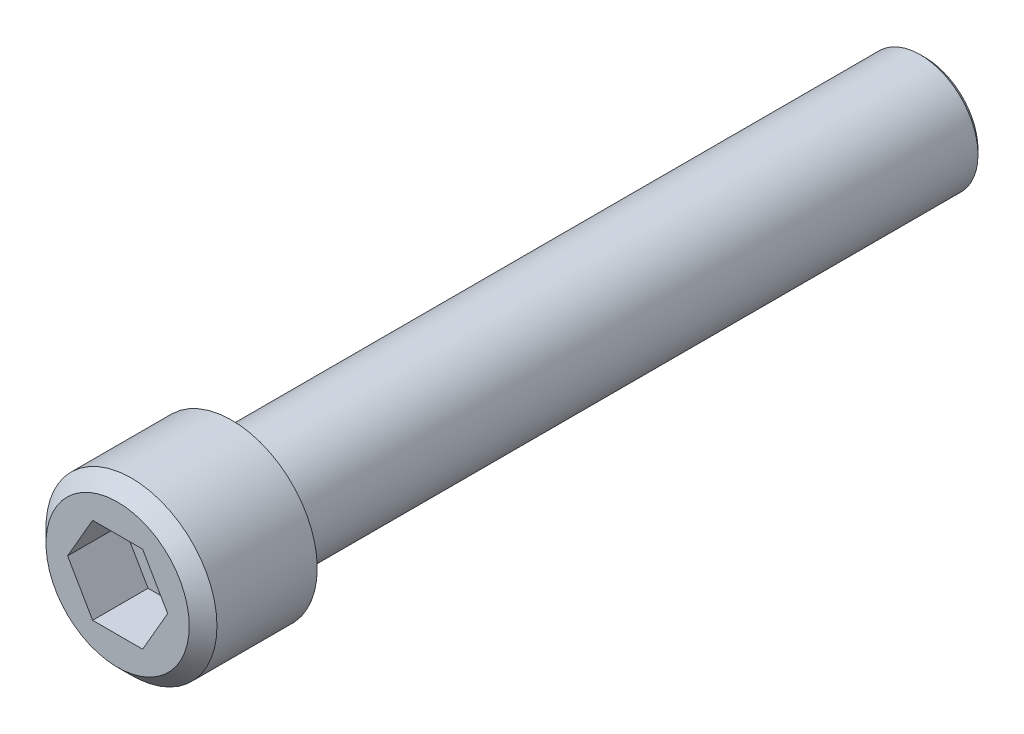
ISO-10303-21;
HEADER;
FILE_DESCRIPTION(('STEP AP214'),'2;1');
FILE_NAME('part.step','',(''),(''),'','','');
FILE_SCHEMA(('AUTOMOTIVE_DESIGN { 1 0 10303 214 1 1 1 1 }'));
ENDSEC;
DATA;
#1=APPLICATION_CONTEXT('core data for automotive mechanical design processes');
#2=APPLICATION_PROTOCOL_DEFINITION('international standard','automotive_design',2000,#1);
#3=PRODUCT_CONTEXT('',#1,'mechanical');
#4=PRODUCT('Part','Part','',(#3));
#5=PRODUCT_RELATED_PRODUCT_CATEGORY('part','',(#4));
#6=PRODUCT_DEFINITION_FORMATION('','',#4);
#7=PRODUCT_DEFINITION_CONTEXT('part definition',#1,'design');
#8=PRODUCT_DEFINITION('design','',#6,#7);
#9=PRODUCT_DEFINITION_SHAPE('','',#8);
#10=(LENGTH_UNIT() NAMED_UNIT(*) SI_UNIT(.MILLI.,.METRE.));
#11=(NAMED_UNIT(*) PLANE_ANGLE_UNIT() SI_UNIT($,.RADIAN.));
#12=(NAMED_UNIT(*) SI_UNIT($,.STERADIAN.) SOLID_ANGLE_UNIT());
#13=UNCERTAINTY_MEASURE_WITH_UNIT(LENGTH_MEASURE(1.E-05),#10,'distance_accuracy_value','');
#14=(GEOMETRIC_REPRESENTATION_CONTEXT(3) GLOBAL_UNCERTAINTY_ASSIGNED_CONTEXT((#13)) GLOBAL_UNIT_ASSIGNED_CONTEXT((#10,
#11,#12)) REPRESENTATION_CONTEXT('',''));
#15=CARTESIAN_POINT('',(0.,0.,0.));
#16=DIRECTION('',(0.,0.,1.));
#17=DIRECTION('',(1.,0.,0.));
#18=AXIS2_PLACEMENT_3D('',#15,#16,#17);
#19=CARTESIAN_POINT('',(0.,0.,-6.2738));
#20=DIRECTION('',(0.,0.,1.));
#21=DIRECTION('',(1.,0.,0.));
#22=AXIS2_PLACEMENT_3D('',#19,#20,#21);
#23=CYLINDRICAL_SURFACE('',#22,4.699);
#24=CARTESIAN_POINT('',(0.,0.,-0.761999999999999));
#25=DIRECTION('',(0.,0.,1.));
#26=DIRECTION('',(1.,0.,0.));
#27=AXIS2_PLACEMENT_3D('',#24,#25,#26);
#28=CIRCLE('',#27,4.699);
#29=CARTESIAN_POINT('',(4.699,0.,-0.762));
#30=VERTEX_POINT('',#29);
#31=EDGE_CURVE('E11',#30,#30,#28,.F.);
#32=CARTESIAN_POINT('',(0.,0.,-6.2738));
#33=DIRECTION('',(0.,0.,1.));
#34=DIRECTION('',(1.,0.,0.));
#35=AXIS2_PLACEMENT_3D('',#32,#33,#34);
#36=CIRCLE('',#35,4.699);
#37=CARTESIAN_POINT('',(4.699,0.,-6.2738));
#38=VERTEX_POINT('',#37);
#39=EDGE_CURVE('E160',#38,#38,#36,.T.);
#40=CARTESIAN_POINT('',(4.699,0.,-0.762));
#41=CARTESIAN_POINT('',(4.699,0.,-0.819414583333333));
#42=CARTESIAN_POINT('',(4.699,0.,-0.876829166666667));
#43=CARTESIAN_POINT('',(4.699,0.,-0.991658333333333));
#44=CARTESIAN_POINT('',(4.699,0.,-1.04907291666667));
#45=CARTESIAN_POINT('',(4.699,0.,-1.16390208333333));
#46=CARTESIAN_POINT('',(4.699,0.,-1.22131666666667));
#47=CARTESIAN_POINT('',(4.699,0.,-1.33614583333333));
#48=CARTESIAN_POINT('',(4.699,0.,-1.39356041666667));
#49=CARTESIAN_POINT('',(4.699,0.,-1.50838958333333));
#50=CARTESIAN_POINT('',(4.699,0.,-1.56580416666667));
#51=CARTESIAN_POINT('',(4.699,0.,-1.68063333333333));
#52=CARTESIAN_POINT('',(4.699,0.,-1.73804791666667));
#53=CARTESIAN_POINT('',(4.699,0.,-1.85287708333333));
#54=CARTESIAN_POINT('',(4.699,0.,-1.91029166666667));
#55=CARTESIAN_POINT('',(4.699,0.,-2.02512083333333));
#56=CARTESIAN_POINT('',(4.699,0.,-2.08253541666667));
#57=CARTESIAN_POINT('',(4.699,0.,-2.19736458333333));
#58=CARTESIAN_POINT('',(4.699,0.,-2.25477916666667));
#59=CARTESIAN_POINT('',(4.699,0.,-2.36960833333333));
#60=CARTESIAN_POINT('',(4.699,0.,-2.42702291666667));
#61=CARTESIAN_POINT('',(4.699,0.,-2.54185208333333));
#62=CARTESIAN_POINT('',(4.699,0.,-2.59926666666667));
#63=CARTESIAN_POINT('',(4.699,0.,-2.71409583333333));
#64=CARTESIAN_POINT('',(4.699,0.,-2.77151041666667));
#65=CARTESIAN_POINT('',(4.699,0.,-2.88633958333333));
#66=CARTESIAN_POINT('',(4.699,0.,-2.94375416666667));
#67=CARTESIAN_POINT('',(4.699,0.,-3.05858333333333));
#68=CARTESIAN_POINT('',(4.699,0.,-3.11599791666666));
#69=CARTESIAN_POINT('',(4.699,0.,-3.23082708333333));
#70=CARTESIAN_POINT('',(4.699,0.,-3.28824166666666));
#71=CARTESIAN_POINT('',(4.699,0.,-3.40307083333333));
#72=CARTESIAN_POINT('',(4.699,0.,-3.46048541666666));
#73=CARTESIAN_POINT('',(4.699,0.,-3.57531458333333));
#74=CARTESIAN_POINT('',(4.699,0.,-3.63272916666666));
#75=CARTESIAN_POINT('',(4.699,0.,-3.74755833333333));
#76=CARTESIAN_POINT('',(4.699,0.,-3.80497291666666));
#77=CARTESIAN_POINT('',(4.699,0.,-3.91980208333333));
#78=CARTESIAN_POINT('',(4.699,0.,-3.97721666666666));
#79=CARTESIAN_POINT('',(4.699,0.,-4.09204583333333));
#80=CARTESIAN_POINT('',(4.699,0.,-4.14946041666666));
#81=CARTESIAN_POINT('',(4.699,0.,-4.26428958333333));
#82=CARTESIAN_POINT('',(4.699,0.,-4.32170416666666));
#83=CARTESIAN_POINT('',(4.699,0.,-4.43653333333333));
#84=CARTESIAN_POINT('',(4.699,0.,-4.49394791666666));
#85=CARTESIAN_POINT('',(4.699,0.,-4.60877708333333));
#86=CARTESIAN_POINT('',(4.699,0.,-4.66619166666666));
#87=CARTESIAN_POINT('',(4.699,0.,-4.78102083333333));
#88=CARTESIAN_POINT('',(4.699,0.,-4.83843541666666));
#89=CARTESIAN_POINT('',(4.699,0.,-4.95326458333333));
#90=CARTESIAN_POINT('',(4.699,0.,-5.01067916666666));
#91=CARTESIAN_POINT('',(4.699,0.,-5.12550833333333));
#92=CARTESIAN_POINT('',(4.699,0.,-5.18292291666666));
#93=CARTESIAN_POINT('',(4.699,0.,-5.29775208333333));
#94=CARTESIAN_POINT('',(4.699,0.,-5.35516666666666));
#95=CARTESIAN_POINT('',(4.699,0.,-5.46999583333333));
#96=CARTESIAN_POINT('',(4.699,0.,-5.52741041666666));
#97=CARTESIAN_POINT('',(4.699,0.,-5.64223958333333));
#98=CARTESIAN_POINT('',(4.699,0.,-5.69965416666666));
#99=CARTESIAN_POINT('',(4.699,0.,-5.81448333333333));
#100=CARTESIAN_POINT('',(4.699,0.,-5.87189791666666));
#101=CARTESIAN_POINT('',(4.699,0.,-5.98672708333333));
#102=CARTESIAN_POINT('',(4.699,0.,-6.04414166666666));
#103=CARTESIAN_POINT('',(4.699,0.,-6.15897083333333));
#104=CARTESIAN_POINT('',(4.699,0.,-6.21638541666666));
#105=CARTESIAN_POINT('',(4.699,0.,-6.2738));
#106=B_SPLINE_CURVE_WITH_KNOTS('',3,(#40,#41,#42,#43,#44,#45,#46,#47,#48,#49,#50,#51,#52,#53,
#54,#55,#56,#57,#58,#59,#60,#61,#62,#63,#64,#65,#66,#67,#68,#69,#70,#71,#72,#73,#74,#75,#76,#77,
#78,#79,#80,#81,#82,#83,#84,#85,#86,#87,#88,#89,#90,#91,#92,#93,#94,#95,#96,#97,#98,#99,#100,
#101,#102,#103,#104,#105),.UNSPECIFIED.,.F.,.F.,(4,2,2,2,2,2,2,2,2,2,2,2,2,2,2,2,2,2,2,2,2,2,2,
2,2,2,2,2,2,2,2,2,4),(0.,0.17224375,0.3444875,0.51673125,0.688975,0.86121875,1.0334625,
1.20570625,1.37795,1.55019375,1.7224375,1.89468125,2.066925,2.23916875,2.4114125,2.58365625,
2.7559,2.92814375,3.1003875,3.27263125,3.444875,3.61711875,3.7893625,3.96160625,4.13385,
4.30609375,4.4783375,4.65058125,4.822825,4.99506875,5.1673125,5.33955625,5.5118),.UNSPECIFIED.);
#107=EDGE_CURVE('BSEAM43',#30,#38,#106,.T.);
#108=ORIENTED_EDGE('',*,*,#31,.T.);
#109=ORIENTED_EDGE('',*,*,#39,.T.);
#110=ORIENTED_EDGE('',*,*,#107,.T.);
#111=ORIENTED_EDGE('',*,*,#107,.F.);
#112=EDGE_LOOP('',(#108,#110,#109,#111));
#113=FACE_BOUND('',#112,.T.);
#114=ADVANCED_FACE('F43',(#113),#23,.T.);
#115=CARTESIAN_POINT('',(0.,0.,-6.2738));
#116=DIRECTION('',(0.,0.,1.));
#117=DIRECTION('',(1.,0.,0.));
#118=AXIS2_PLACEMENT_3D('',#115,#116,#117);
#119=PLANE('',#118);
#120=CARTESIAN_POINT('',(0.,0.,-6.2738));
#121=DIRECTION('',(0.,0.,1.));
#122=DIRECTION('',(1.,0.,0.));
#123=AXIS2_PLACEMENT_3D('',#120,#121,#122);
#124=CIRCLE('',#123,3.175);
#125=CARTESIAN_POINT('',(3.175,0.,-6.2738));
#126=VERTEX_POINT('',#125);
#127=EDGE_CURVE('E172',#126,#126,#124,.F.);
#128=ORIENTED_EDGE('',*,*,#127,.F.);
#129=EDGE_LOOP('',(#128));
#130=FACE_BOUND('',#129,.T.);
#131=ORIENTED_EDGE('',*,*,#39,.F.);
#132=EDGE_LOOP('',(#131));
#133=FACE_BOUND('',#132,.T.);
#134=ADVANCED_FACE('F200',(#130,#133),#119,.F.);
#135=CARTESIAN_POINT('',(0.,0.,0.));
#136=DIRECTION('',(0.,0.,1.));
#137=DIRECTION('',(1.,0.,0.));
#138=AXIS2_PLACEMENT_3D('',#135,#136,#137);
#139=PLANE('',#138);
#140=CARTESIAN_POINT('',(0.,0.,0.));
#141=DIRECTION('',(0.,0.,1.));
#142=DIRECTION('',(1.,0.,0.));
#143=AXIS2_PLACEMENT_3D('',#140,#141,#142);
#144=CIRCLE('',#143,3.937);
#145=CARTESIAN_POINT('',(3.937,0.,0.));
#146=VERTEX_POINT('',#145);
#147=EDGE_CURVE('E52',#146,#146,#144,.T.);
#148=ORIENTED_EDGE('',*,*,#147,.T.);
#149=EDGE_LOOP('',(#148));
#150=FACE_BOUND('',#149,.T.);
#151=DIRECTION('',(0.5,0.866025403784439,0.));
#152=VECTOR('',#151,1.);
#153=CARTESIAN_POINT('',(1.37481532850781,-2.38125,0.));
#154=LINE('',#153,#152);
#155=CARTESIAN_POINT('',(1.37481532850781,-2.38125,0.));
#156=VERTEX_POINT('',#155);
#157=CARTESIAN_POINT('',(2.74963065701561,0.,0.));
#158=VERTEX_POINT('',#157);
#159=EDGE_CURVE('E59',#156,#158,#154,.T.);
#160=ORIENTED_EDGE('',*,*,#159,.F.);
#161=DIRECTION('',(1.,0.,0.));
#162=VECTOR('',#161,1.);
#163=CARTESIAN_POINT('',(-1.37481532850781,-2.38125,0.));
#164=LINE('',#163,#162);
#165=CARTESIAN_POINT('',(-1.37481532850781,-2.38125,0.));
#166=VERTEX_POINT('',#165);
#167=EDGE_CURVE('E154',#166,#156,#164,.T.);
#168=ORIENTED_EDGE('',*,*,#167,.F.);
#169=DIRECTION('',(0.5,-0.866025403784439,0.));
#170=VECTOR('',#169,1.);
#171=CARTESIAN_POINT('',(-2.74963065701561,0.,0.));
#172=LINE('',#171,#170);
#173=CARTESIAN_POINT('',(-2.74963065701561,0.,0.));
#174=VERTEX_POINT('',#173);
#175=EDGE_CURVE('E151',#174,#166,#172,.T.);
#176=ORIENTED_EDGE('',*,*,#175,.F.);
#177=DIRECTION('',(-0.5,-0.866025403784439,0.));
#178=VECTOR('',#177,1.);
#179=CARTESIAN_POINT('',(-1.37481532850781,2.38125,0.));
#180=LINE('',#179,#178);
#181=CARTESIAN_POINT('',(-1.37481532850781,2.38125,0.));
#182=VERTEX_POINT('',#181);
#183=EDGE_CURVE('E107',#182,#174,#180,.T.);
#184=ORIENTED_EDGE('',*,*,#183,.F.);
#185=DIRECTION('',(-1.,0.,0.));
#186=VECTOR('',#185,1.);
#187=CARTESIAN_POINT('',(1.37481532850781,2.38125,0.));
#188=LINE('',#187,#186);
#189=CARTESIAN_POINT('',(1.37481532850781,2.38125,0.));
#190=VERTEX_POINT('',#189);
#191=EDGE_CURVE('E146',#190,#182,#188,.T.);
#192=ORIENTED_EDGE('',*,*,#191,.F.);
#193=DIRECTION('',(-0.5,0.866025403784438,0.));
#194=VECTOR('',#193,1.);
#195=CARTESIAN_POINT('',(2.74963065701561,0.,0.));
#196=LINE('',#195,#194);
#197=EDGE_CURVE('E142',#158,#190,#196,.T.);
#198=ORIENTED_EDGE('',*,*,#197,.F.);
#199=EDGE_LOOP('',(#160,#168,#176,#184,#192,#198));
#200=FACE_BOUND('',#199,.T.);
#201=ADVANCED_FACE('F188',(#150,#200),#139,.T.);
#202=CARTESIAN_POINT('',(0.,0.,-44.3738));
#203=DIRECTION('',(0.,0.,1.));
#204=DIRECTION('',(1.,0.,0.));
#205=AXIS2_PLACEMENT_3D('',#202,#203,#204);
#206=CYLINDRICAL_SURFACE('',#205,3.175);
#207=CARTESIAN_POINT('',(0.,0.,-44.1198));
#208=DIRECTION('',(0.,0.,-1.));
#209=DIRECTION('',(-1.,0.,0.));
#210=AXIS2_PLACEMENT_3D('',#207,#208,#209);
#211=CIRCLE('',#210,3.175);
#212=CARTESIAN_POINT('',(3.175,0.,-44.1198));
#213=VERTEX_POINT('',#212);
#214=EDGE_CURVE('E180',#213,#213,#211,.F.);
#215=CARTESIAN_POINT('',(3.175,0.,-44.1198));
#216=CARTESIAN_POINT('',(3.175,0.,-43.7255708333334));
#217=CARTESIAN_POINT('',(3.175,0.,-43.3313416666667));
#218=CARTESIAN_POINT('',(3.175,0.,-42.5428833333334));
#219=CARTESIAN_POINT('',(3.175,0.,-42.1486541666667));
#220=CARTESIAN_POINT('',(3.175,0.,-41.3601958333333));
#221=CARTESIAN_POINT('',(3.175,0.,-40.9659666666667));
#222=CARTESIAN_POINT('',(3.175,0.,-40.1775083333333));
#223=CARTESIAN_POINT('',(3.175,0.,-39.7832791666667));
#224=CARTESIAN_POINT('',(3.175,0.,-38.9948208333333));
#225=CARTESIAN_POINT('',(3.175,0.,-38.6005916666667));
#226=CARTESIAN_POINT('',(3.175,0.,-37.8121333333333));
#227=CARTESIAN_POINT('',(3.175,0.,-37.4179041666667));
#228=CARTESIAN_POINT('',(3.175,0.,-36.6294458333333));
#229=CARTESIAN_POINT('',(3.175,0.,-36.2352166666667));
#230=CARTESIAN_POINT('',(3.175,0.,-35.4467583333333));
#231=CARTESIAN_POINT('',(3.175,0.,-35.0525291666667));
#232=CARTESIAN_POINT('',(3.175,0.,-34.2640708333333));
#233=CARTESIAN_POINT('',(3.175,0.,-33.8698416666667));
#234=CARTESIAN_POINT('',(3.175,0.,-33.0813833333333));
#235=CARTESIAN_POINT('',(3.175,0.,-32.6871541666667));
#236=CARTESIAN_POINT('',(3.175,0.,-31.8986958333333));
#237=CARTESIAN_POINT('',(3.175,0.,-31.5044666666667));
#238=CARTESIAN_POINT('',(3.175,0.,-30.7160083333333));
#239=CARTESIAN_POINT('',(3.175,0.,-30.3217791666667));
#240=CARTESIAN_POINT('',(3.175,0.,-29.5333208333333));
#241=CARTESIAN_POINT('',(3.175,0.,-29.1390916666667));
#242=CARTESIAN_POINT('',(3.175,0.,-28.3506333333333));
#243=CARTESIAN_POINT('',(3.175,0.,-27.9564041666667));
#244=CARTESIAN_POINT('',(3.175,0.,-27.1679458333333));
#245=CARTESIAN_POINT('',(3.175,0.,-26.7737166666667));
#246=CARTESIAN_POINT('',(3.175,0.,-25.9852583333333));
#247=CARTESIAN_POINT('',(3.175,0.,-25.5910291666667));
#248=CARTESIAN_POINT('',(3.175,0.,-24.8025708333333));
#249=CARTESIAN_POINT('',(3.175,0.,-24.4083416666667));
#250=CARTESIAN_POINT('',(3.175,0.,-23.6198833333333));
#251=CARTESIAN_POINT('',(3.175,0.,-23.2256541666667));
#252=CARTESIAN_POINT('',(3.175,0.,-22.4371958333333));
#253=CARTESIAN_POINT('',(3.175,0.,-22.0429666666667));
#254=CARTESIAN_POINT('',(3.175,0.,-21.2545083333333));
#255=CARTESIAN_POINT('',(3.175,0.,-20.8602791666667));
#256=CARTESIAN_POINT('',(3.175,0.,-20.0718208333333));
#257=CARTESIAN_POINT('',(3.175,0.,-19.6775916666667));
#258=CARTESIAN_POINT('',(3.175,0.,-18.8891333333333));
#259=CARTESIAN_POINT('',(3.175,0.,-18.4949041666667));
#260=CARTESIAN_POINT('',(3.175,0.,-17.7064458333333));
#261=CARTESIAN_POINT('',(3.175,0.,-17.3122166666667));
#262=CARTESIAN_POINT('',(3.175,0.,-16.5237583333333));
#263=CARTESIAN_POINT('',(3.175,0.,-16.1295291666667));
#264=CARTESIAN_POINT('',(3.175,0.,-15.3410708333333));
#265=CARTESIAN_POINT('',(3.175,0.,-14.9468416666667));
#266=CARTESIAN_POINT('',(3.175,0.,-14.1583833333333));
#267=CARTESIAN_POINT('',(3.175,0.,-13.7641541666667));
#268=CARTESIAN_POINT('',(3.175,0.,-12.9756958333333));
#269=CARTESIAN_POINT('',(3.175,0.,-12.5814666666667));
#270=CARTESIAN_POINT('',(3.175,0.,-11.7930083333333));
#271=CARTESIAN_POINT('',(3.175,0.,-11.3987791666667));
#272=CARTESIAN_POINT('',(3.175,0.,-10.6103208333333));
#273=CARTESIAN_POINT('',(3.175,0.,-10.2160916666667));
#274=CARTESIAN_POINT('',(3.175,0.,-9.42763333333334));
#275=CARTESIAN_POINT('',(3.175,0.,-9.03340416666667));
#276=CARTESIAN_POINT('',(3.175,0.,-8.24494583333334));
#277=CARTESIAN_POINT('',(3.175,0.,-7.85071666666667));
#278=CARTESIAN_POINT('',(3.175,0.,-7.06225833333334));
#279=CARTESIAN_POINT('',(3.175,0.,-6.66802916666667));
#280=CARTESIAN_POINT('',(3.175,0.,-6.2738));
#281=B_SPLINE_CURVE_WITH_KNOTS('',3,(#215,#216,#217,#218,#219,#220,#221,#222,#223,#224,#225,
#226,#227,#228,#229,#230,#231,#232,#233,#234,#235,#236,#237,#238,#239,#240,#241,#242,#243,#244,
#245,#246,#247,#248,#249,#250,#251,#252,#253,#254,#255,#256,#257,#258,#259,#260,#261,#262,#263,
#264,#265,#266,#267,#268,#269,#270,#271,#272,#273,#274,#275,#276,#277,#278,#279,#280),
.UNSPECIFIED.,.F.,.F.,(4,2,2,2,2,2,2,2,2,2,2,2,2,2,2,2,2,2,2,2,2,2,2,2,2,2,2,2,2,2,2,2,4),(0.,
1.1826875,2.365375,3.5480625,4.73075000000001,5.91343750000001,7.09612500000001,8.2788125,
9.4615,10.6441875,11.826875,13.0095625,14.19225,15.3749375,16.557625,17.7403125,18.923,
20.1056875,21.288375,22.4710625,23.65375,24.8364375,26.019125,27.2018125,28.3845,29.5671875,
30.749875,31.9325625,33.11525,34.2979375,35.480625,36.6633125,37.846),.UNSPECIFIED.);
#282=EDGE_CURVE('BSEAM211',#213,#126,#281,.T.);
#283=ORIENTED_EDGE('',*,*,#214,.T.);
#284=ORIENTED_EDGE('',*,*,#127,.T.);
#285=ORIENTED_EDGE('',*,*,#282,.T.);
#286=ORIENTED_EDGE('',*,*,#282,.F.);
#287=EDGE_LOOP('',(#283,#285,#284,#286));
#288=FACE_BOUND('',#287,.T.);
#289=ADVANCED_FACE('F211',(#288),#206,.T.);
#290=CARTESIAN_POINT('',(0.,0.,-44.3738));
#291=DIRECTION('',(0.,0.,-1.));
#292=DIRECTION('',(-1.,0.,0.));
#293=AXIS2_PLACEMENT_3D('',#290,#291,#292);
#294=PLANE('',#293);
#295=CARTESIAN_POINT('',(0.,0.,-44.3738));
#296=DIRECTION('',(0.,0.,-1.));
#297=DIRECTION('',(-1.,0.,0.));
#298=AXIS2_PLACEMENT_3D('',#295,#296,#297);
#299=CIRCLE('',#298,2.921);
#300=CARTESIAN_POINT('',(-2.921,0.,-44.3738));
#301=VERTEX_POINT('',#300);
#302=EDGE_CURVE('E176',#301,#301,#299,.T.);
#303=ORIENTED_EDGE('',*,*,#302,.T.);
#304=EDGE_LOOP('',(#303));
#305=FACE_BOUND('',#304,.T.);
#306=ADVANCED_FACE('F215',(#305),#294,.T.);
#307=CARTESIAN_POINT('',(1.37481532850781,-2.38125,-3.048));
#308=DIRECTION('',(0.866025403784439,-0.5,0.));
#309=DIRECTION('',(0.5,0.866025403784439,0.));
#310=AXIS2_PLACEMENT_3D('',#307,#308,#309);
#311=PLANE('',#310);
#312=ORIENTED_EDGE('',*,*,#159,.T.);
#313=DIRECTION('',(0.,0.,1.));
#314=VECTOR('',#313,1.);
#315=CARTESIAN_POINT('',(2.74963065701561,0.,-3.048));
#316=LINE('',#315,#314);
#317=CARTESIAN_POINT('',(2.74963065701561,0.,-3.048));
#318=VERTEX_POINT('',#317);
#319=EDGE_CURVE('E89',#318,#158,#316,.T.);
#320=ORIENTED_EDGE('',*,*,#319,.F.);
#321=DIRECTION('',(0.5,0.866025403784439,0.));
#322=VECTOR('',#321,1.);
#323=CARTESIAN_POINT('',(1.37481532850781,-2.38125,-3.048));
#324=LINE('',#323,#322);
#325=CARTESIAN_POINT('',(1.37481532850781,-2.38125,-3.048));
#326=VERTEX_POINT('',#325);
#327=EDGE_CURVE('E157',#326,#318,#324,.T.);
#328=ORIENTED_EDGE('',*,*,#327,.F.);
#329=DIRECTION('',(0.,0.,1.));
#330=VECTOR('',#329,1.);
#331=CARTESIAN_POINT('',(1.37481532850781,-2.38125,-3.048));
#332=LINE('',#331,#330);
#333=EDGE_CURVE('E67',#326,#156,#332,.T.);
#334=ORIENTED_EDGE('',*,*,#333,.T.);
#335=EDGE_LOOP('',(#312,#320,#328,#334));
#336=FACE_BOUND('',#335,.T.);
#337=ADVANCED_FACE('F219',(#336),#311,.F.);
#338=CARTESIAN_POINT('',(-1.37481532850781,-2.38125,-3.048));
#339=DIRECTION('',(0.,-1.,0.));
#340=DIRECTION('',(0.,0.,-1.));
#341=AXIS2_PLACEMENT_3D('',#338,#339,#340);
#342=PLANE('',#341);
#343=ORIENTED_EDGE('',*,*,#167,.T.);
#344=ORIENTED_EDGE('',*,*,#333,.F.);
#345=DIRECTION('',(1.,0.,0.));
#346=VECTOR('',#345,1.);
#347=CARTESIAN_POINT('',(-1.37481532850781,-2.38125,-3.048));
#348=LINE('',#347,#346);
#349=CARTESIAN_POINT('',(-1.37481532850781,-2.38125,-3.048));
#350=VERTEX_POINT('',#349);
#351=EDGE_CURVE('E121',#350,#326,#348,.T.);
#352=ORIENTED_EDGE('',*,*,#351,.F.);
#353=DIRECTION('',(0.,0.,1.));
#354=VECTOR('',#353,1.);
#355=CARTESIAN_POINT('',(-1.37481532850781,-2.38125,-3.048));
#356=LINE('',#355,#354);
#357=EDGE_CURVE('E112',#350,#166,#356,.T.);
#358=ORIENTED_EDGE('',*,*,#357,.T.);
#359=EDGE_LOOP('',(#343,#344,#352,#358));
#360=FACE_BOUND('',#359,.T.);
#361=ADVANCED_FACE('F223',(#360),#342,.F.);
#362=CARTESIAN_POINT('',(-2.74963065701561,0.,-3.048));
#363=DIRECTION('',(-0.866025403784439,-0.5,0.));
#364=DIRECTION('',(0.5,-0.866025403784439,0.));
#365=AXIS2_PLACEMENT_3D('',#362,#363,#364);
#366=PLANE('',#365);
#367=ORIENTED_EDGE('',*,*,#175,.T.);
#368=ORIENTED_EDGE('',*,*,#357,.F.);
#369=DIRECTION('',(0.5,-0.866025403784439,0.));
#370=VECTOR('',#369,1.);
#371=CARTESIAN_POINT('',(-2.74963065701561,0.,-3.048));
#372=LINE('',#371,#370);
#373=CARTESIAN_POINT('',(-2.74963065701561,0.,-3.048));
#374=VERTEX_POINT('',#373);
#375=EDGE_CURVE('E116',#374,#350,#372,.T.);
#376=ORIENTED_EDGE('',*,*,#375,.F.);
#377=DIRECTION('',(0.,0.,1.));
#378=VECTOR('',#377,1.);
#379=CARTESIAN_POINT('',(-2.74963065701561,0.,-3.048));
#380=LINE('',#379,#378);
#381=EDGE_CURVE('E100',#374,#174,#380,.T.);
#382=ORIENTED_EDGE('',*,*,#381,.T.);
#383=EDGE_LOOP('',(#367,#368,#376,#382));
#384=FACE_BOUND('',#383,.T.);
#385=ADVANCED_FACE('F117',(#384),#366,.F.);
#386=CARTESIAN_POINT('',(-1.37481532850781,2.38125,-3.048));
#387=DIRECTION('',(-0.866025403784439,0.5,0.));
#388=DIRECTION('',(-0.5,-0.866025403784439,0.));
#389=AXIS2_PLACEMENT_3D('',#386,#387,#388);
#390=PLANE('',#389);
#391=ORIENTED_EDGE('',*,*,#183,.T.);
#392=ORIENTED_EDGE('',*,*,#381,.F.);
#393=DIRECTION('',(-0.5,-0.866025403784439,0.));
#394=VECTOR('',#393,1.);
#395=CARTESIAN_POINT('',(-1.37481532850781,2.38125,-3.048));
#396=LINE('',#395,#394);
#397=CARTESIAN_POINT('',(-1.37481532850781,2.38125,-3.048));
#398=VERTEX_POINT('',#397);
#399=EDGE_CURVE('E104',#398,#374,#396,.T.);
#400=ORIENTED_EDGE('',*,*,#399,.F.);
#401=DIRECTION('',(0.,0.,1.));
#402=VECTOR('',#401,1.);
#403=CARTESIAN_POINT('',(-1.37481532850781,2.38125,-3.048));
#404=LINE('',#403,#402);
#405=EDGE_CURVE('E113',#398,#182,#404,.T.);
#406=ORIENTED_EDGE('',*,*,#405,.T.);
#407=EDGE_LOOP('',(#391,#392,#400,#406));
#408=FACE_BOUND('',#407,.T.);
#409=ADVANCED_FACE('F102',(#408),#390,.F.);
#410=CARTESIAN_POINT('',(1.37481532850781,2.38125,-3.048));
#411=DIRECTION('',(0.,1.,0.));
#412=DIRECTION('',(0.,0.,1.));
#413=AXIS2_PLACEMENT_3D('',#410,#411,#412);
#414=PLANE('',#413);
#415=ORIENTED_EDGE('',*,*,#191,.T.);
#416=ORIENTED_EDGE('',*,*,#405,.F.);
#417=DIRECTION('',(-1.,0.,0.));
#418=VECTOR('',#417,1.);
#419=CARTESIAN_POINT('',(1.37481532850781,2.38125,-3.048));
#420=LINE('',#419,#418);
#421=CARTESIAN_POINT('',(1.37481532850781,2.38125,-3.048));
#422=VERTEX_POINT('',#421);
#423=EDGE_CURVE('E127',#422,#398,#420,.T.);
#424=ORIENTED_EDGE('',*,*,#423,.F.);
#425=DIRECTION('',(0.,0.,1.));
#426=VECTOR('',#425,1.);
#427=CARTESIAN_POINT('',(1.37481532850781,2.38125,-3.048));
#428=LINE('',#427,#426);
#429=EDGE_CURVE('E164',#422,#190,#428,.T.);
#430=ORIENTED_EDGE('',*,*,#429,.T.);
#431=EDGE_LOOP('',(#415,#416,#424,#430));
#432=FACE_BOUND('',#431,.T.);
#433=ADVANCED_FACE('F227',(#432),#414,.F.);
#434=CARTESIAN_POINT('',(2.74963065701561,0.,-3.048));
#435=DIRECTION('',(0.866025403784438,0.5,0.));
#436=DIRECTION('',(-0.5,0.866025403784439,0.));
#437=AXIS2_PLACEMENT_3D('',#434,#435,#436);
#438=PLANE('',#437);
#439=ORIENTED_EDGE('',*,*,#197,.T.);
#440=ORIENTED_EDGE('',*,*,#429,.F.);
#441=DIRECTION('',(-0.5,0.866025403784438,0.));
#442=VECTOR('',#441,1.);
#443=CARTESIAN_POINT('',(2.74963065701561,0.,-3.048));
#444=LINE('',#443,#442);
#445=EDGE_CURVE('E134',#318,#422,#444,.T.);
#446=ORIENTED_EDGE('',*,*,#445,.F.);
#447=ORIENTED_EDGE('',*,*,#319,.T.);
#448=EDGE_LOOP('',(#439,#440,#446,#447));
#449=FACE_BOUND('',#448,.T.);
#450=ADVANCED_FACE('F224',(#449),#438,.F.);
#451=CARTESIAN_POINT('',(4.12444598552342,2.38125,-3.048));
#452=DIRECTION('',(0.,0.,1.));
#453=DIRECTION('',(1.,0.,0.));
#454=AXIS2_PLACEMENT_3D('',#451,#452,#453);
#455=PLANE('',#454);
#456=ORIENTED_EDGE('',*,*,#327,.T.);
#457=ORIENTED_EDGE('',*,*,#445,.T.);
#458=ORIENTED_EDGE('',*,*,#423,.T.);
#459=ORIENTED_EDGE('',*,*,#399,.T.);
#460=ORIENTED_EDGE('',*,*,#375,.T.);
#461=ORIENTED_EDGE('',*,*,#351,.T.);
#462=EDGE_LOOP('',(#456,#457,#458,#459,#460,#461));
#463=FACE_BOUND('',#462,.T.);
#464=ADVANCED_FACE('F124',(#463),#455,.T.);
#465=CARTESIAN_POINT('',(0.,0.,-44.3738));
#466=DIRECTION('',(0.,0.,1.));
#467=DIRECTION('',(1.,0.,0.));
#468=AXIS2_PLACEMENT_3D('',#465,#466,#467);
#469=CONICAL_SURFACE('',#468,2.921,0.785398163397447);
#470=ORIENTED_EDGE('',*,*,#214,.F.);
#471=EDGE_LOOP('',(#470));
#472=FACE_BOUND('',#471,.T.);
#473=ORIENTED_EDGE('',*,*,#302,.F.);
#474=EDGE_LOOP('',(#473));
#475=FACE_BOUND('',#474,.T.);
#476=ADVANCED_FACE('F192',(#472,#475),#469,.T.);
#477=CARTESIAN_POINT('',(0.,0.,0.));
#478=DIRECTION('',(0.,0.,-1.));
#479=DIRECTION('',(-1.,0.,0.));
#480=AXIS2_PLACEMENT_3D('',#477,#478,#479);
#481=CONICAL_SURFACE('',#480,3.937,0.785398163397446);
#482=ORIENTED_EDGE('',*,*,#31,.F.);
#483=EDGE_LOOP('',(#482));
#484=FACE_BOUND('',#483,.T.);
#485=ORIENTED_EDGE('',*,*,#147,.F.);
#486=EDGE_LOOP('',(#485));
#487=FACE_BOUND('',#486,.T.);
#488=ADVANCED_FACE('F45',(#484,#487),#481,.T.);
#489=CLOSED_SHELL('',(#114,#134,#201,#289,#306,#337,#361,#385,#409,#433,#450,#464,#476,#488));
#490=MANIFOLD_SOLID_BREP('B2',#489);
#491=ADVANCED_BREP_SHAPE_REPRESENTATION('',(#18,#490),#14);
#492=SHAPE_DEFINITION_REPRESENTATION(#9,#491);
ENDSEC;
END-ISO-10303-21;
